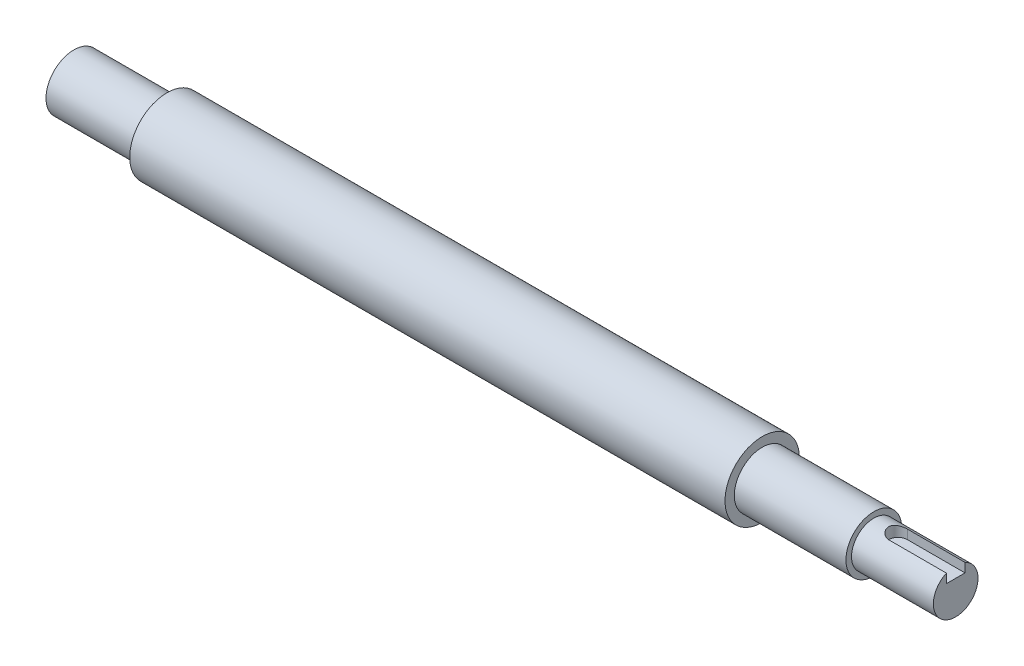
ISO-10303-21;
HEADER;
FILE_DESCRIPTION(('STEP AP214'),'2;1');
FILE_NAME('part.step','',(''),(''),'','','');
FILE_SCHEMA(('AUTOMOTIVE_DESIGN { 1 0 10303 214 1 1 1 1 }'));
ENDSEC;
DATA;
#1=APPLICATION_CONTEXT('core data for automotive mechanical design processes');
#2=APPLICATION_PROTOCOL_DEFINITION('international standard','automotive_design',2000,#1);
#3=PRODUCT_CONTEXT('',#1,'mechanical');
#4=PRODUCT('Part','Part','',(#3));
#5=PRODUCT_RELATED_PRODUCT_CATEGORY('part','',(#4));
#6=PRODUCT_DEFINITION_FORMATION('','',#4);
#7=PRODUCT_DEFINITION_CONTEXT('part definition',#1,'design');
#8=PRODUCT_DEFINITION('design','',#6,#7);
#9=PRODUCT_DEFINITION_SHAPE('','',#8);
#10=(LENGTH_UNIT() NAMED_UNIT(*) SI_UNIT(.MILLI.,.METRE.));
#11=(NAMED_UNIT(*) PLANE_ANGLE_UNIT() SI_UNIT($,.RADIAN.));
#12=(NAMED_UNIT(*) SI_UNIT($,.STERADIAN.) SOLID_ANGLE_UNIT());
#13=UNCERTAINTY_MEASURE_WITH_UNIT(LENGTH_MEASURE(1.E-05),#10,'distance_accuracy_value','');
#14=(GEOMETRIC_REPRESENTATION_CONTEXT(3) GLOBAL_UNCERTAINTY_ASSIGNED_CONTEXT((#13)) GLOBAL_UNIT_ASSIGNED_CONTEXT((#10,
#11,#12)) REPRESENTATION_CONTEXT('',''));
#15=CARTESIAN_POINT('',(0.,0.,0.));
#16=DIRECTION('',(0.,0.,1.));
#17=DIRECTION('',(1.,0.,0.));
#18=AXIS2_PLACEMENT_3D('',#15,#16,#17);
#19=CARTESIAN_POINT('',(36.5,5.45435605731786,0.));
#20=DIRECTION('',(0.,1.,0.));
#21=DIRECTION('',(0.,0.,1.));
#22=AXIS2_PLACEMENT_3D('',#19,#20,#21);
#23=CYLINDRICAL_SURFACE('',#22,2.5);
#24=DIRECTION('',(0.,-1.,0.));
#25=VECTOR('',#24,1.);
#26=CARTESIAN_POINT('',(36.5,5.45435605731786,-2.5));
#27=LINE('',#26,#25);
#28=CARTESIAN_POINT('',(36.5,5.45435605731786,-2.5));
#29=VERTEX_POINT('',#28);
#30=CARTESIAN_POINT('',(36.5,3.,-2.5));
#31=VERTEX_POINT('',#30);
#32=EDGE_CURVE('E123',#29,#31,#27,.T.);
#33=ORIENTED_EDGE('',*,*,#32,.F.);
#34=CARTESIAN_POINT('',(36.5,5.45435605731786,2.5));
#35=CARTESIAN_POINT('',(36.433009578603,5.4543414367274,2.50001024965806));
#36=CARTESIAN_POINT('',(36.3660271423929,5.45558986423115,2.49730766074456));
#37=CARTESIAN_POINT('',(36.232608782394,5.46050344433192,2.48655699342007));
#38=CARTESIAN_POINT('',(36.1661726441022,5.46416759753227,2.47851112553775));
#39=CARTESIAN_POINT('',(36.0345981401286,5.47378318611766,2.45719882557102));
#40=CARTESIAN_POINT('',(35.9694554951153,5.47972494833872,2.44395446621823));
#41=CARTESIAN_POINT('',(35.8406523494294,5.49369035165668,2.41239773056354));
#42=CARTESIAN_POINT('',(35.7769919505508,5.50171413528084,2.39408500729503));
#43=CARTESIAN_POINT('',(35.5890295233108,5.52852216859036,2.33184505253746));
#44=CARTESIAN_POINT('',(35.4674650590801,5.55006534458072,2.28056973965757));
#45=CARTESIAN_POINT('',(35.234605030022,5.5980502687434,2.16009667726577));
#46=CARTESIAN_POINT('',(35.1233203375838,5.62449711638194,2.09088024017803));
#47=CARTESIAN_POINT('',(34.9073444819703,5.68111739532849,1.93194216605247));
#48=CARTESIAN_POINT('',(34.8033685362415,5.71141645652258,1.84129131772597));
#49=CARTESIAN_POINT('',(34.6115830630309,5.77129106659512,1.64402473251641));
#50=CARTESIAN_POINT('',(34.5237769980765,5.80086645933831,1.53740558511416));
#51=CARTESIAN_POINT('',(34.3631011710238,5.85751079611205,1.3055266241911));
#52=CARTESIAN_POINT('',(34.2910465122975,5.88441492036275,1.17965801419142));
#53=CARTESIAN_POINT('',(34.1694476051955,5.93113050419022,0.91626334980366));
#54=CARTESIAN_POINT('',(34.1198932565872,5.95094514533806,0.778742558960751));
#55=CARTESIAN_POINT('',(34.0473214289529,5.98035028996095,0.503538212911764));
#56=CARTESIAN_POINT('',(34.0230570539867,5.99041924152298,0.366235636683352));
#57=CARTESIAN_POINT('',(33.997724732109,6.00093656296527,0.0891608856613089));
#58=CARTESIAN_POINT('',(33.9966477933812,6.00138866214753,-0.0506103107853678));
#59=CARTESIAN_POINT('',(34.0170686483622,5.99290254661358,-0.319586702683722));
#60=CARTESIAN_POINT('',(34.0371965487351,5.98453414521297,-0.448917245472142));
#61=CARTESIAN_POINT('',(34.0971069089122,5.96013005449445,-0.702167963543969));
#62=CARTESIAN_POINT('',(34.1368904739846,5.94409393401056,-0.826087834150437));
#63=CARTESIAN_POINT('',(34.2354557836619,5.90559715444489,-1.06727556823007));
#64=CARTESIAN_POINT('',(34.2945181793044,5.88304219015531,-1.1844130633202));
#65=CARTESIAN_POINT('',(34.4296907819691,5.83371457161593,-1.40742238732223));
#66=CARTESIAN_POINT('',(34.5058071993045,5.80694038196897,-1.51329009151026));
#67=CARTESIAN_POINT('',(34.6791590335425,5.74963576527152,-1.71867537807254));
#68=CARTESIAN_POINT('',(34.7775041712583,5.71897359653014,-1.81722082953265));
#69=CARTESIAN_POINT('',(34.9894106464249,5.65876079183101,-1.99685313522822));
#70=CARTESIAN_POINT('',(35.1029796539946,5.62921072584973,-2.07793113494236));
#71=CARTESIAN_POINT('',(35.3468546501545,5.57361619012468,-2.22284514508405));
#72=CARTESIAN_POINT('',(35.4775928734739,5.54772171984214,-2.28601504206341));
#73=CARTESIAN_POINT('',(35.7491453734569,5.50417661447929,-2.38897619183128));
#74=CARTESIAN_POINT('',(35.8899405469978,5.48651080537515,-2.4288105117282));
#75=CARTESIAN_POINT('',(36.1101508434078,5.46773287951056,-2.47065526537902));
#76=CARTESIAN_POINT('',(36.1876310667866,5.46274303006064,-2.48164099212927));
#77=CARTESIAN_POINT('',(36.3433901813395,5.45604541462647,-2.49631631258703));
#78=CARTESIAN_POINT('',(36.4216687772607,5.45433647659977,-2.50000851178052));
#79=CARTESIAN_POINT('',(36.5,5.45435605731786,-2.5));
#80=B_SPLINE_CURVE_WITH_KNOTS('',3,(#34,#35,#36,#37,#38,#39,#40,#41,#42,#43,#44,#45,#46,#47,#48,
#49,#50,#51,#52,#53,#54,#55,#56,#57,#58,#59,#60,#61,#62,#63,#64,#65,#66,#67,#68,#69,#70,#71,#72,
#73,#74,#75,#76,#77,#78,#79),.UNSPECIFIED.,.F.,.F.,(4,2,2,2,2,2,2,2,2,2,2,2,2,2,2,2,2,2,2,2,2,2,
4),(0.,0.200891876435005,0.401700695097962,0.601665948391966,0.801644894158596,1.20075599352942,
1.6002844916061,2.02212344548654,2.44405262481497,2.88432120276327,3.32439195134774,
3.74155898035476,4.15856423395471,4.5501908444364,4.94183947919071,5.33946474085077,
5.73723503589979,6.16301556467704,6.58901142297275,7.02923147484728,7.46863649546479,
7.70350874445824,7.93829707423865),.UNSPECIFIED.);
#81=CARTESIAN_POINT('',(36.5,5.45435605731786,2.5));
#82=VERTEX_POINT('',#81);
#83=EDGE_CURVE('E11',#29,#82,#80,.F.);
#84=ORIENTED_EDGE('',*,*,#83,.T.);
#85=DIRECTION('',(0.,-1.,0.));
#86=VECTOR('',#85,1.);
#87=CARTESIAN_POINT('',(36.5,5.45435605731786,2.5));
#88=LINE('',#87,#86);
#89=CARTESIAN_POINT('',(36.5,3.,2.5));
#90=VERTEX_POINT('',#89);
#91=EDGE_CURVE('E126',#90,#82,#88,.F.);
#92=ORIENTED_EDGE('',*,*,#91,.F.);
#93=CARTESIAN_POINT('',(36.5,3.,0.));
#94=DIRECTION('',(0.,-1.,0.));
#95=DIRECTION('',(0.,0.,-1.));
#96=AXIS2_PLACEMENT_3D('',#93,#94,#95);
#97=CIRCLE('',#96,2.5);
#98=EDGE_CURVE('E43',#31,#90,#97,.F.);
#99=ORIENTED_EDGE('',*,*,#98,.F.);
#100=EDGE_LOOP('',(#33,#84,#92,#99));
#101=FACE_BOUND('',#100,.T.);
#102=ADVANCED_FACE('F31',(#101),#23,.F.);
#103=CARTESIAN_POINT('',(-160.,0.,0.));
#104=DIRECTION('',(1.,0.,0.));
#105=DIRECTION('',(0.,0.,-1.));
#106=AXIS2_PLACEMENT_3D('',#103,#104,#105);
#107=PLANE('',#106);
#108=CARTESIAN_POINT('',(-160.,0.,0.));
#109=DIRECTION('',(1.,0.,0.));
#110=DIRECTION('',(0.,0.,-1.));
#111=AXIS2_PLACEMENT_3D('',#108,#109,#110);
#112=CIRCLE('',#111,10.);
#113=CARTESIAN_POINT('',(-160.,0.,-10.));
#114=VERTEX_POINT('',#113);
#115=EDGE_CURVE('E110',#114,#114,#112,.T.);
#116=ORIENTED_EDGE('',*,*,#115,.F.);
#117=EDGE_LOOP('',(#116));
#118=FACE_BOUND('',#117,.T.);
#119=CARTESIAN_POINT('',(-160.,0.,0.));
#120=DIRECTION('',(1.,0.,0.));
#121=DIRECTION('',(0.,0.,-1.));
#122=AXIS2_PLACEMENT_3D('',#119,#120,#121);
#123=CIRCLE('',#122,7.5);
#124=CARTESIAN_POINT('',(-160.,0.,-7.5));
#125=VERTEX_POINT('',#124);
#126=EDGE_CURVE('E113',#125,#125,#123,.F.);
#127=ORIENTED_EDGE('',*,*,#126,.F.);
#128=EDGE_LOOP('',(#127));
#129=FACE_BOUND('',#128,.T.);
#130=ADVANCED_FACE('F134',(#118,#129),#107,.F.);
#131=CARTESIAN_POINT('',(0.,0.,0.));
#132=DIRECTION('',(1.,0.,0.));
#133=DIRECTION('',(0.,0.,-1.));
#134=AXIS2_PLACEMENT_3D('',#131,#132,#133);
#135=PLANE('',#134);
#136=CARTESIAN_POINT('',(0.,0.,0.));
#137=DIRECTION('',(1.,0.,0.));
#138=DIRECTION('',(0.,0.,-1.));
#139=AXIS2_PLACEMENT_3D('',#136,#137,#138);
#140=CIRCLE('',#139,10.);
#141=CARTESIAN_POINT('',(0.,0.,-10.));
#142=VERTEX_POINT('',#141);
#143=EDGE_CURVE('E109',#142,#142,#140,.T.);
#144=ORIENTED_EDGE('',*,*,#143,.T.);
#145=EDGE_LOOP('',(#144));
#146=FACE_BOUND('',#145,.T.);
#147=CARTESIAN_POINT('',(0.,0.,0.));
#148=DIRECTION('',(1.,0.,0.));
#149=DIRECTION('',(0.,0.,-1.));
#150=AXIS2_PLACEMENT_3D('',#147,#148,#149);
#151=CIRCLE('',#150,7.5);
#152=CARTESIAN_POINT('',(0.,0.,-7.5));
#153=VERTEX_POINT('',#152);
#154=EDGE_CURVE('E100',#153,#153,#151,.T.);
#155=ORIENTED_EDGE('',*,*,#154,.F.);
#156=EDGE_LOOP('',(#155));
#157=FACE_BOUND('',#156,.T.);
#158=ADVANCED_FACE('F138',(#146,#157),#135,.T.);
#159=CARTESIAN_POINT('',(-160.,0.,0.));
#160=DIRECTION('',(1.,0.,0.));
#161=DIRECTION('',(0.,0.,-1.));
#162=AXIS2_PLACEMENT_3D('',#159,#160,#161);
#163=CYLINDRICAL_SURFACE('',#162,10.);
#164=ORIENTED_EDGE('',*,*,#115,.T.);
#165=EDGE_LOOP('',(#164));
#166=FACE_BOUND('',#165,.T.);
#167=ORIENTED_EDGE('',*,*,#143,.F.);
#168=EDGE_LOOP('',(#167));
#169=FACE_BOUND('',#168,.T.);
#170=ADVANCED_FACE('F144',(#166,#169),#163,.T.);
#171=CARTESIAN_POINT('',(30.,0.,0.));
#172=DIRECTION('',(1.,0.,0.));
#173=DIRECTION('',(0.,0.,-1.));
#174=AXIS2_PLACEMENT_3D('',#171,#172,#173);
#175=PLANE('',#174);
#176=CARTESIAN_POINT('',(30.,0.,0.));
#177=DIRECTION('',(1.,0.,0.));
#178=DIRECTION('',(0.,0.,-1.));
#179=AXIS2_PLACEMENT_3D('',#176,#177,#178);
#180=CIRCLE('',#179,7.5);
#181=CARTESIAN_POINT('',(30.,0.,-7.5));
#182=VERTEX_POINT('',#181);
#183=EDGE_CURVE('E101',#182,#182,#180,.T.);
#184=ORIENTED_EDGE('',*,*,#183,.T.);
#185=EDGE_LOOP('',(#184));
#186=FACE_BOUND('',#185,.T.);
#187=CARTESIAN_POINT('',(30.,0.,0.));
#188=DIRECTION('',(1.,0.,0.));
#189=DIRECTION('',(0.,0.,-1.));
#190=AXIS2_PLACEMENT_3D('',#187,#188,#189);
#191=CIRCLE('',#190,6.);
#192=CARTESIAN_POINT('',(30.,0.,-6.));
#193=VERTEX_POINT('',#192);
#194=EDGE_CURVE('E104',#193,#193,#191,.T.);
#195=ORIENTED_EDGE('',*,*,#194,.F.);
#196=EDGE_LOOP('',(#195));
#197=FACE_BOUND('',#196,.T.);
#198=ADVANCED_FACE('F152',(#186,#197),#175,.T.);
#199=CARTESIAN_POINT('',(30.,0.,0.));
#200=DIRECTION('',(-1.,0.,0.));
#201=DIRECTION('',(0.,0.,1.));
#202=AXIS2_PLACEMENT_3D('',#199,#200,#201);
#203=CYLINDRICAL_SURFACE('',#202,7.5);
#204=ORIENTED_EDGE('',*,*,#183,.F.);
#205=EDGE_LOOP('',(#204));
#206=FACE_BOUND('',#205,.T.);
#207=ORIENTED_EDGE('',*,*,#154,.T.);
#208=EDGE_LOOP('',(#207));
#209=FACE_BOUND('',#208,.T.);
#210=ADVANCED_FACE('F157',(#206,#209),#203,.T.);
#211=CARTESIAN_POINT('',(52.,0.,0.));
#212=DIRECTION('',(1.,0.,0.));
#213=DIRECTION('',(0.,0.,-1.));
#214=AXIS2_PLACEMENT_3D('',#211,#212,#213);
#215=PLANE('',#214);
#216=DIRECTION('',(0.,-1.,0.));
#217=VECTOR('',#216,1.);
#218=CARTESIAN_POINT('',(52.,3.,2.5));
#219=LINE('',#218,#217);
#220=CARTESIAN_POINT('',(52.,5.45435605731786,2.5));
#221=VERTEX_POINT('',#220);
#222=CARTESIAN_POINT('',(52.,3.,2.5));
#223=VERTEX_POINT('',#222);
#224=EDGE_CURVE('E83',#221,#223,#219,.T.);
#225=ORIENTED_EDGE('',*,*,#224,.F.);
#226=CARTESIAN_POINT('',(52.,0.,0.));
#227=DIRECTION('',(1.,0.,0.));
#228=DIRECTION('',(0.,0.,-1.));
#229=AXIS2_PLACEMENT_3D('',#226,#227,#228);
#230=CIRCLE('',#229,6.);
#231=CARTESIAN_POINT('',(52.,5.45435605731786,-2.5));
#232=VERTEX_POINT('',#231);
#233=EDGE_CURVE('E107',#221,#232,#230,.T.);
#234=ORIENTED_EDGE('',*,*,#233,.T.);
#235=DIRECTION('',(0.,1.,0.));
#236=VECTOR('',#235,1.);
#237=CARTESIAN_POINT('',(52.,6.,-2.5));
#238=LINE('',#237,#236);
#239=CARTESIAN_POINT('',(52.,3.,-2.5));
#240=VERTEX_POINT('',#239);
#241=EDGE_CURVE('E80',#240,#232,#238,.T.);
#242=ORIENTED_EDGE('',*,*,#241,.F.);
#243=DIRECTION('',(0.,0.,-1.));
#244=VECTOR('',#243,1.);
#245=CARTESIAN_POINT('',(52.,3.,-2.5));
#246=LINE('',#245,#244);
#247=EDGE_CURVE('E76',#223,#240,#246,.T.);
#248=ORIENTED_EDGE('',*,*,#247,.F.);
#249=EDGE_LOOP('',(#225,#234,#242,#248));
#250=FACE_BOUND('',#249,.T.);
#251=ADVANCED_FACE('F91',(#250),#215,.T.);
#252=CARTESIAN_POINT('',(52.,0.,0.));
#253=DIRECTION('',(-1.,0.,0.));
#254=DIRECTION('',(0.,0.,1.));
#255=AXIS2_PLACEMENT_3D('',#252,#253,#254);
#256=CYLINDRICAL_SURFACE('',#255,6.);
#257=ORIENTED_EDGE('',*,*,#83,.F.);
#258=DIRECTION('',(-1.,0.,0.));
#259=VECTOR('',#258,1.);
#260=CARTESIAN_POINT('',(52.,5.45435605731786,-2.5));
#261=LINE('',#260,#259);
#262=EDGE_CURVE('E120',#29,#232,#261,.F.);
#263=ORIENTED_EDGE('',*,*,#262,.T.);
#264=ORIENTED_EDGE('',*,*,#233,.F.);
#265=DIRECTION('',(-1.,0.,0.));
#266=VECTOR('',#265,1.);
#267=CARTESIAN_POINT('',(52.,5.45435605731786,2.5));
#268=LINE('',#267,#266);
#269=EDGE_CURVE('E86',#221,#82,#268,.T.);
#270=ORIENTED_EDGE('',*,*,#269,.T.);
#271=EDGE_LOOP('',(#257,#263,#264,#270));
#272=FACE_BOUND('',#271,.T.);
#273=ORIENTED_EDGE('',*,*,#194,.T.);
#274=EDGE_LOOP('',(#273));
#275=FACE_BOUND('',#274,.T.);
#276=ADVANCED_FACE('F128',(#272,#275),#256,.T.);
#277=CARTESIAN_POINT('',(-185.,0.,0.));
#278=DIRECTION('',(1.,0.,0.));
#279=DIRECTION('',(0.,0.,-1.));
#280=AXIS2_PLACEMENT_3D('',#277,#278,#279);
#281=CYLINDRICAL_SURFACE('',#280,7.5);
#282=CARTESIAN_POINT('',(-185.,0.,0.));
#283=DIRECTION('',(-1.,0.,0.));
#284=DIRECTION('',(0.,0.,1.));
#285=AXIS2_PLACEMENT_3D('',#282,#283,#284);
#286=CIRCLE('',#285,7.5);
#287=CARTESIAN_POINT('',(-185.,0.,7.5));
#288=VERTEX_POINT('',#287);
#289=EDGE_CURVE('E96',#288,#288,#286,.T.);
#290=ORIENTED_EDGE('',*,*,#289,.F.);
#291=EDGE_LOOP('',(#290));
#292=FACE_BOUND('',#291,.T.);
#293=ORIENTED_EDGE('',*,*,#126,.T.);
#294=EDGE_LOOP('',(#293));
#295=FACE_BOUND('',#294,.T.);
#296=ADVANCED_FACE('F173',(#292,#295),#281,.T.);
#297=CARTESIAN_POINT('',(-185.,0.,0.));
#298=DIRECTION('',(-1.,0.,0.));
#299=DIRECTION('',(0.,0.,1.));
#300=AXIS2_PLACEMENT_3D('',#297,#298,#299);
#301=PLANE('',#300);
#302=ORIENTED_EDGE('',*,*,#289,.T.);
#303=EDGE_LOOP('',(#302));
#304=FACE_BOUND('',#303,.T.);
#305=ADVANCED_FACE('F176',(#304),#301,.T.);
#306=CARTESIAN_POINT('',(34.,3.,2.5));
#307=DIRECTION('',(0.,0.,1.));
#308=DIRECTION('',(1.,0.,0.));
#309=AXIS2_PLACEMENT_3D('',#306,#307,#308);
#310=PLANE('',#309);
#311=DIRECTION('',(1.,0.,0.));
#312=VECTOR('',#311,1.);
#313=CARTESIAN_POINT('',(34.,3.,2.5));
#314=LINE('',#313,#312);
#315=EDGE_CURVE('E72',#90,#223,#314,.T.);
#316=ORIENTED_EDGE('',*,*,#315,.F.);
#317=ORIENTED_EDGE('',*,*,#91,.T.);
#318=ORIENTED_EDGE('',*,*,#269,.F.);
#319=ORIENTED_EDGE('',*,*,#224,.T.);
#320=EDGE_LOOP('',(#316,#317,#318,#319));
#321=FACE_BOUND('',#320,.T.);
#322=ADVANCED_FACE('F84',(#321),#310,.F.);
#323=CARTESIAN_POINT('',(34.,6.,-2.5));
#324=DIRECTION('',(0.,0.,-1.));
#325=DIRECTION('',(-1.,0.,0.));
#326=AXIS2_PLACEMENT_3D('',#323,#324,#325);
#327=PLANE('',#326);
#328=ORIENTED_EDGE('',*,*,#262,.F.);
#329=ORIENTED_EDGE('',*,*,#32,.T.);
#330=DIRECTION('',(1.,0.,0.));
#331=VECTOR('',#330,1.);
#332=CARTESIAN_POINT('',(34.,3.,-2.5));
#333=LINE('',#332,#331);
#334=EDGE_CURVE('E79',#31,#240,#333,.T.);
#335=ORIENTED_EDGE('',*,*,#334,.T.);
#336=ORIENTED_EDGE('',*,*,#241,.T.);
#337=EDGE_LOOP('',(#328,#329,#335,#336));
#338=FACE_BOUND('',#337,.T.);
#339=ADVANCED_FACE('F132',(#338),#327,.F.);
#340=CARTESIAN_POINT('',(34.,3.,-2.5));
#341=DIRECTION('',(0.,-1.,0.));
#342=DIRECTION('',(0.,0.,-1.));
#343=AXIS2_PLACEMENT_3D('',#340,#341,#342);
#344=PLANE('',#343);
#345=ORIENTED_EDGE('',*,*,#334,.F.);
#346=ORIENTED_EDGE('',*,*,#98,.T.);
#347=ORIENTED_EDGE('',*,*,#315,.T.);
#348=ORIENTED_EDGE('',*,*,#247,.T.);
#349=EDGE_LOOP('',(#345,#346,#347,#348));
#350=FACE_BOUND('',#349,.T.);
#351=ADVANCED_FACE('F74',(#350),#344,.F.);
#352=CLOSED_SHELL('',(#102,#130,#158,#170,#198,#210,#251,#276,#296,#305,#322,#339,#351));
#353=MANIFOLD_SOLID_BREP('B2',#352);
#354=ADVANCED_BREP_SHAPE_REPRESENTATION('',(#18,#353),#14);
#355=SHAPE_DEFINITION_REPRESENTATION(#9,#354);
ENDSEC;
END-ISO-10303-21;
